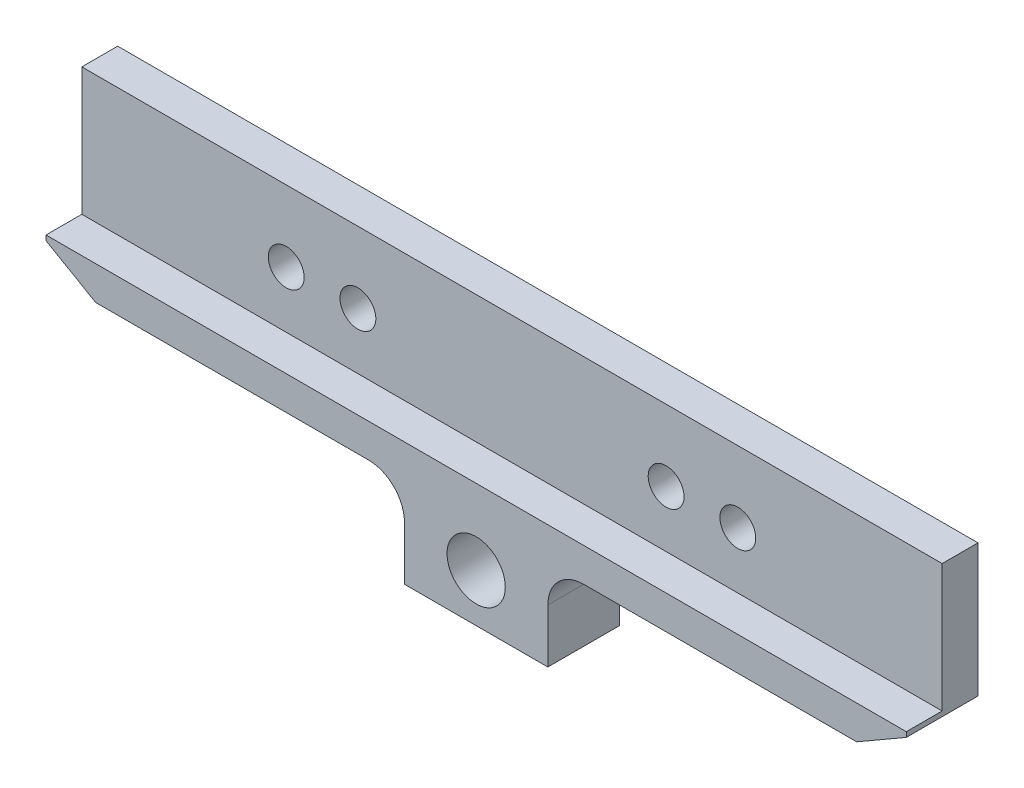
from build123d import *
from build123d.topology import SkipClean

# Parameters (mm, degrees)
SKETCH1_R           = 2.57937
SKETCH1_R_2         = 1.588135
BOSS_EXTRUDE1_DEPTH = 3.175
SKETCH2_W           = 80
SKETCH2_H           = 16.442491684
CUT_EXTRUDE1_DEPTH  = 3.175
SKETCH3_W           = 23.864304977
SKETCH3_H           = 13.601839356
SKETCH3_W_2         = 6.35
SKETCH3_H_2         = 6.760195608
CUT_EXTRUDE2_DEPTH  = 47.228697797
FILLET2_R           = 1.5875
BOSS_EXTRUDE2_START = -6.35
BOSS_EXTRUDE2_DEPTH = 6.35
CUT_EXTRUDE3_DEPTH  = 47.228697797


with BuildPart() as part:
    # Sketch1 → Boss-Extrude1 (new, symmetric)
    with BuildSketch(Plane.XY):
        with BuildLine():
            Line((-38.1, 0), (38.1, 0))
            Line((38.1, 0), (38.1, -14.853340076))
            ThreePointArc((38.1, -14.853340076), (0, -25.4), (-38.1, -14.853340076))
            Line((-38.1, -14.853340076), (-38.1, 0))
        make_face()
        with Locations((0, -17.9832)):
            Circle(SKETCH1_R, mode=Mode.SUBTRACT)
        with Locations((13.65, -6.3082)):
            Circle(SKETCH1_R_2, mode=Mode.SUBTRACT)
        with Locations((20, -6.3082)):
            Circle(SKETCH1_R_2, mode=Mode.SUBTRACT)
        with Locations((-20, -6.3082)):
            Circle(SKETCH1_R_2, mode=Mode.SUBTRACT)
        with Locations((-13.65, -6.3082)):
            Circle(SKETCH1_R_2, mode=Mode.SUBTRACT)
    extrude(amount=BOSS_EXTRUDE1_DEPTH, both=True)

    # Sketch2 → Cut-Extrude1 (cut)
    with BuildSketch(Plane.XY.offset(3.175)):
        with Locations((0, -3.086954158)):
            Rectangle(SKETCH2_W, SKETCH2_H)
    extrude(amount=-CUT_EXTRUDE1_DEPTH, mode=Mode.SUBTRACT)

    # Sketch3 → Cut-Extrude2 (cut, through all)
    with BuildSketch(Plane(origin=(0, 0, -3.175), x_dir=(-1, 0, 0), z_dir=(0, 0, -1))):
        with Locations((-30.982152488, -24.260879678)):
            Rectangle(SKETCH3_W, SKETCH3_H)
        with Locations((-9.525, -24.265635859)):
            Rectangle(SKETCH3_W_2, SKETCH3_H_2)
        with Locations((9.525, -24.265635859)):
            Rectangle(SKETCH3_W_2, SKETCH3_H_2)
        with Locations((30.982152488, -24.260879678)):
            Rectangle(SKETCH3_W, SKETCH3_H)
    extrude(amount=-CUT_EXTRUDE2_DEPTH, mode=Mode.SUBTRACT)

    # Fillet2
    fillet2_edges = [part.edges().sort_by_distance(p)[0] for p in [
        (-12.7, -20.885538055, 0),
        (-6.35, -20.885538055, 0),
        (-19.05, -17.45996, 0),
        (19.05, -17.45996, 0),
        (6.35, -20.885538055, 0),
        (12.7, -20.885538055, 0),
    ]]
    fillet(fillet2_edges, radius=FILLET2_R)

    # Sketch4 → Boss-Extrude2 (add)
    with SkipClean():  # the faces are left unmerged after this step: merging them gives an invalid solid
        with BuildSketch(Plane(origin=(0, 0, -3.175), x_dir=(-1, 0, 0), z_dir=(0, 0, -1)).offset(BOSS_EXTRUDE2_START)):
            with BuildLine():
                Line((19.05, -22.909124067), (19.05, -19.04746))
                ThreePointArc((19.05, -19.04746), (19.514967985, -17.924927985), (20.6375, -17.45996))
                Line((20.6375, -17.45996), (33.369738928, -17.45996))
                ThreePointArc((33.369738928, -17.45996), (26.351102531, -20.555685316), (19.05, -22.909124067))
            make_face()
            with BuildLine():
                Line((-33.369738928, -17.45996), (-20.6375, -17.45996))
                ThreePointArc((-20.6375, -17.45996), (-19.514967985, -17.924927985), (-19.05, -19.04746))
                Line((-19.05, -19.04746), (-19.05, -22.909124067))
                ThreePointArc((-19.05, -22.909124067), (-26.351102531, -20.555685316), (-33.369738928, -17.45996))
            make_face()
            with BuildLine():
                Line((-12.7, -24.303438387), (-12.7, -22.473038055))
                ThreePointArc((-12.7, -22.473038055), (-12.235032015, -21.35050604), (-11.1125, -20.885538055))
                Line((-11.1125, -20.885538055), (-7.9375, -20.885538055))
                ThreePointArc((-7.9375, -20.885538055), (-6.814967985, -21.35050604), (-6.35, -22.473038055))
                Line((-6.35, -22.473038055), (-6.35, -25.127386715))
                ThreePointArc((-6.35, -25.127386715), (-9.533905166, -24.78404283), (-12.7, -24.303438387))
            make_face()
            with BuildLine():
                Line((6.35, -25.127386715), (6.35, -22.473038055))
                ThreePointArc((6.35, -22.473038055), (6.814967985, -21.35050604), (7.9375, -20.885538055))
                Line((7.9375, -20.885538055), (11.1125, -20.885538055))
                ThreePointArc((11.1125, -20.885538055), (12.235032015, -21.35050604), (12.7, -22.473038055))
                Line((12.7, -22.473038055), (12.7, -24.303438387))
                ThreePointArc((12.7, -24.303438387), (9.533905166, -24.78404283), (6.35, -25.127386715))
            make_face()
        extrude(amount=BOSS_EXTRUDE2_DEPTH)

    # Sketch5 → Cut-Extrude3 (cut, through all)
    with BuildSketch(Plane(origin=(0, 0, -3.175), x_dir=(-1, 0, 0), z_dir=(0, 0, -1))):
        with BuildLine():
            Line((6.35, -22.225), (-6.35, -22.225))
            Line((-6.35, -22.225), (-6.35, -17.4625))
            ThreePointArc((-6.35, -17.4625), (-7.27993597, -15.21743597), (-9.525, -14.2875))
            Line((-9.525, -14.2875), (-33.700590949, -14.2875))
            Line((-33.700590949, -14.2875), (-38.1, -11.7475))
            Line((-38.1, -11.7475), (-38.1, -14.853340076))
            ThreePointArc((-38.1, -14.853340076), (0, -25.4), (38.1, -14.853340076))
            Line((38.1, -14.853340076), (38.1, -11.7475))
            Line((38.1, -11.7475), (33.700590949, -14.2875))
            Line((33.700590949, -14.2875), (9.525, -14.2875))
            ThreePointArc((9.525, -14.2875), (7.27993597, -15.21743597), (6.35, -17.4625))
            Line((6.35, -17.4625), (6.35, -22.225))
        make_face()
    extrude(amount=-CUT_EXTRUDE3_DEPTH, mode=Mode.SUBTRACT)


solid = part.part
